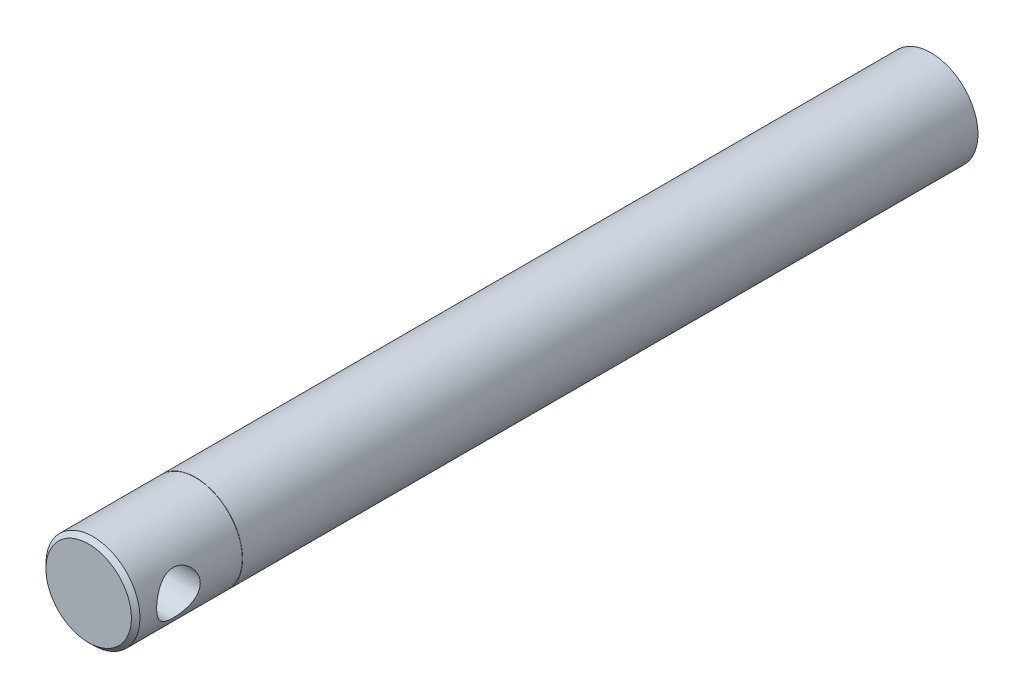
from build123d import *

# Parameters (mm, degrees)
ESQUISSE1_R                  = 11
ESQUISSE1_R_2                = 10
EXTRUSION1_DEPTH             = 172
ESQUISSE2_R                  = 10.95
EXTRUSION2_DEPTH             = 0.1
ESQUISSE3_R                  = 11
EXTRUSION3_DEPTH             = 24.9
ENL_V_MAT_EXTRU_2_DEPTH      = 198.613258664
ENL_V_MAT_EXTRU_2_DEPTH_BACK = 198.613258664
ESQUISSE5_R                  = 5.1
CHANFREIN1_SIZE              = 1


with BuildPart() as part:
    # Esquisse1 → Extrusion1 (new body)
    with BuildSketch(Plane.XY):
        Circle(ESQUISSE1_R)
        Circle(ESQUISSE1_R_2, mode=Mode.SUBTRACT)
    extrude(amount=EXTRUSION1_DEPTH)

    # Esquisse2 → Extrusion2 (add)
    with BuildSketch(Plane.XY.offset(172)):
        Circle(ESQUISSE2_R)
    extrude(amount=EXTRUSION2_DEPTH)

    # Esquisse3 → Extrusion3 (add)
    with BuildSketch(Plane.XY.offset(172.1)):
        Circle(ESQUISSE3_R)
    extrude(amount=EXTRUSION3_DEPTH)

    # Esquisse5 → Enl_v. mat.-Extru.2 (cut, two sides: drawn at the far end of the back side and taken through both)
    with BuildSketch(Plane(origin=(0, 0, 0), x_dir=(0, 0, -1), z_dir=(1, 0, 0)).offset(-ENL_V_MAT_EXTRU_2_DEPTH_BACK)):
        with Locations((-187, 0)):
            Circle(ESQUISSE5_R)
    extrude(amount=ENL_V_MAT_EXTRU_2_DEPTH + ENL_V_MAT_EXTRU_2_DEPTH_BACK, mode=Mode.SUBTRACT)

    # Chanfrein1
    chanfrein1_edges = [part.edges().sort_by_distance(p)[0] for p in [
        (-11, 0, 197),
    ]]
    chamfer(chanfrein1_edges, length=CHANFREIN1_SIZE)


solid = part.part
